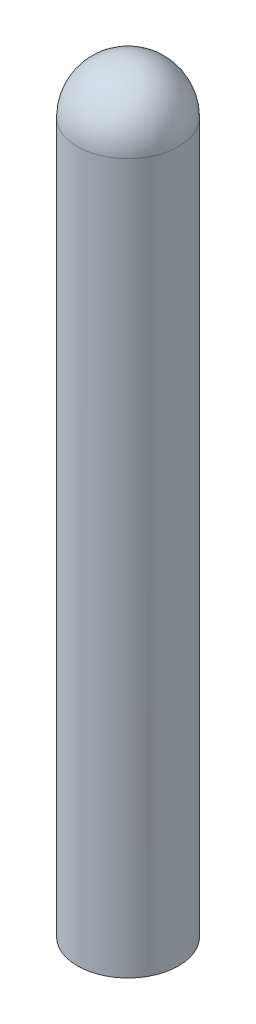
ISO-10303-21;
HEADER;
FILE_DESCRIPTION(('STEP AP214'),'2;1');
FILE_NAME('part.step','',(''),(''),'','','');
FILE_SCHEMA(('AUTOMOTIVE_DESIGN { 1 0 10303 214 1 1 1 1 }'));
ENDSEC;
DATA;
#1=APPLICATION_CONTEXT('core data for automotive mechanical design processes');
#2=APPLICATION_PROTOCOL_DEFINITION('international standard','automotive_design',2000,#1);
#3=PRODUCT_CONTEXT('',#1,'mechanical');
#4=PRODUCT('Part','Part','',(#3));
#5=PRODUCT_RELATED_PRODUCT_CATEGORY('part','',(#4));
#6=PRODUCT_DEFINITION_FORMATION('','',#4);
#7=PRODUCT_DEFINITION_CONTEXT('part definition',#1,'design');
#8=PRODUCT_DEFINITION('design','',#6,#7);
#9=PRODUCT_DEFINITION_SHAPE('','',#8);
#10=(LENGTH_UNIT() NAMED_UNIT(*) SI_UNIT(.MILLI.,.METRE.));
#11=(NAMED_UNIT(*) PLANE_ANGLE_UNIT() SI_UNIT($,.RADIAN.));
#12=(NAMED_UNIT(*) SI_UNIT($,.STERADIAN.) SOLID_ANGLE_UNIT());
#13=UNCERTAINTY_MEASURE_WITH_UNIT(LENGTH_MEASURE(1.E-05),#10,'distance_accuracy_value','');
#14=(GEOMETRIC_REPRESENTATION_CONTEXT(3) GLOBAL_UNCERTAINTY_ASSIGNED_CONTEXT((#13)) GLOBAL_UNIT_ASSIGNED_CONTEXT((#10,
#11,#12)) REPRESENTATION_CONTEXT('',''));
#15=CARTESIAN_POINT('',(0.,0.,0.));
#16=DIRECTION('',(0.,0.,1.));
#17=DIRECTION('',(1.,0.,0.));
#18=AXIS2_PLACEMENT_3D('',#15,#16,#17);
#19=CARTESIAN_POINT('',(-40.795,-45.7699999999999,0.));
#20=DIRECTION('',(0.,-1.,0.));
#21=DIRECTION('',(1.,0.,0.));
#22=AXIS2_PLACEMENT_3D('',#19,#20,#21);
#23=CYLINDRICAL_SURFACE('',#22,1.4925);
#24=CARTESIAN_POINT('',(-40.795,-47.2625,0.));
#25=DIRECTION('',(0.,-1.,0.));
#26=DIRECTION('',(0.,0.,1.));
#27=AXIS2_PLACEMENT_3D('',#24,#25,#26);
#28=CIRCLE('',#27,1.4925);
#29=CARTESIAN_POINT('',(-40.795,-47.2625,1.4925));
#30=VERTEX_POINT('',#29);
#31=EDGE_CURVE('E9',#30,#30,#28,.T.);
#32=ORIENTED_EDGE('',*,*,#31,.T.);
#33=EDGE_LOOP('',(#32));
#34=FACE_BOUND('',#33,.T.);
#35=CARTESIAN_POINT('',(-40.795,-68.2,0.));
#36=DIRECTION('',(0.,-1.,0.));
#37=DIRECTION('',(1.,0.,0.));
#38=AXIS2_PLACEMENT_3D('',#35,#36,#37);
#39=CIRCLE('',#38,1.4925);
#40=CARTESIAN_POINT('',(-39.3025,-68.2,0.));
#41=VERTEX_POINT('',#40);
#42=EDGE_CURVE('E20',#41,#41,#39,.T.);
#43=ORIENTED_EDGE('',*,*,#42,.F.);
#44=EDGE_LOOP('',(#43));
#45=FACE_BOUND('',#44,.T.);
#46=ADVANCED_FACE('F13',(#34,#45),#23,.T.);
#47=CARTESIAN_POINT('',(-40.795,-47.2625,0.));
#48=DIRECTION('',(0.,0.,1.));
#49=DIRECTION('',(-1.,0.,0.));
#50=AXIS2_PLACEMENT_3D('',#47,#48,#49);
#51=SPHERICAL_SURFACE('',#50,1.4925);
#52=CARTESIAN_POINT('',(-40.795,-47.2625,0.));
#53=DIRECTION('',(0.,-1.,0.));
#54=DIRECTION('',(0.,0.,1.));
#55=AXIS2_PLACEMENT_3D('',#52,#53,#54);
#56=SPHERICAL_SURFACE('',#55,1.4925);
#57=ORIENTED_EDGE('',*,*,#31,.F.);
#58=EDGE_LOOP('',(#57));
#59=FACE_BOUND('',#58,.T.);
#60=ADVANCED_FACE('F32',(#59),#56,.T.);
#61=CARTESIAN_POINT('',(-40.795,-68.2,0.));
#62=DIRECTION('',(0.,-1.,0.));
#63=DIRECTION('',(1.,0.,0.));
#64=AXIS2_PLACEMENT_3D('',#61,#62,#63);
#65=PLANE('',#64);
#66=ORIENTED_EDGE('',*,*,#42,.T.);
#67=EDGE_LOOP('',(#66));
#68=FACE_BOUND('',#67,.T.);
#69=ADVANCED_FACE('F29',(#68),#65,.T.);
#70=CLOSED_SHELL('',(#46,#60,#69));
#71=MANIFOLD_SOLID_BREP('B1',#70);
#72=ADVANCED_BREP_SHAPE_REPRESENTATION('',(#18,#71),#14);
#73=SHAPE_DEFINITION_REPRESENTATION(#9,#72);
ENDSEC;
END-ISO-10303-21;
